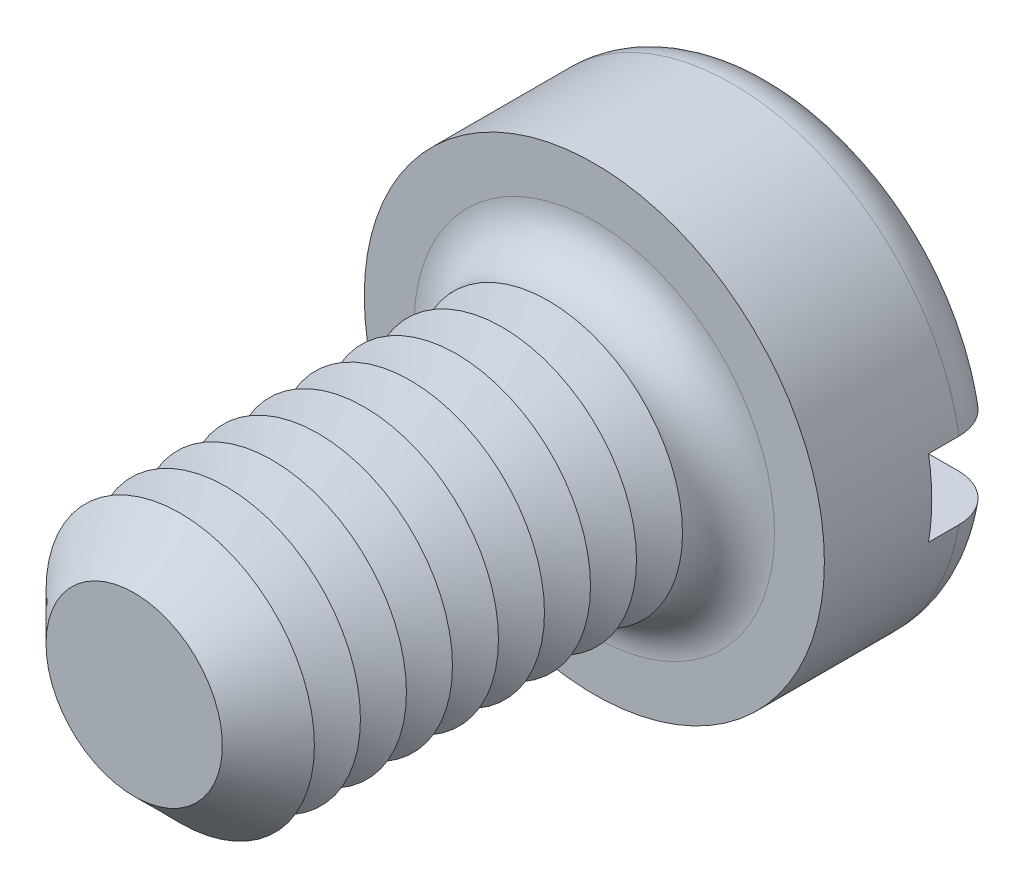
ISO-10303-21;
HEADER;
FILE_DESCRIPTION(('STEP AP214'),'2;1');
FILE_NAME('part.step','',(''),(''),'','','');
FILE_SCHEMA(('AUTOMOTIVE_DESIGN { 1 0 10303 214 1 1 1 1 }'));
ENDSEC;
DATA;
#1=APPLICATION_CONTEXT('core data for automotive mechanical design processes');
#2=APPLICATION_PROTOCOL_DEFINITION('international standard','automotive_design',2000,#1);
#3=PRODUCT_CONTEXT('',#1,'mechanical');
#4=PRODUCT('Part','Part','',(#3));
#5=PRODUCT_RELATED_PRODUCT_CATEGORY('part','',(#4));
#6=PRODUCT_DEFINITION_FORMATION('','',#4);
#7=PRODUCT_DEFINITION_CONTEXT('part definition',#1,'design');
#8=PRODUCT_DEFINITION('design','',#6,#7);
#9=PRODUCT_DEFINITION_SHAPE('','',#8);
#10=(LENGTH_UNIT() NAMED_UNIT(*) SI_UNIT(.MILLI.,.METRE.));
#11=(NAMED_UNIT(*) PLANE_ANGLE_UNIT() SI_UNIT($,.RADIAN.));
#12=(NAMED_UNIT(*) SI_UNIT($,.STERADIAN.) SOLID_ANGLE_UNIT());
#13=UNCERTAINTY_MEASURE_WITH_UNIT(LENGTH_MEASURE(1.E-05),#10,'distance_accuracy_value','');
#14=(GEOMETRIC_REPRESENTATION_CONTEXT(3) GLOBAL_UNCERTAINTY_ASSIGNED_CONTEXT((#13)) GLOBAL_UNIT_ASSIGNED_CONTEXT((#10,
#11,#12)) REPRESENTATION_CONTEXT('',''));
#15=CARTESIAN_POINT('',(0.,0.,0.));
#16=DIRECTION('',(0.,0.,1.));
#17=DIRECTION('',(1.,0.,0.));
#18=AXIS2_PLACEMENT_3D('',#15,#16,#17);
#19=CARTESIAN_POINT('',(0.,0.,-2.4));
#20=DIRECTION('',(0.,0.,1.));
#21=DIRECTION('',(1.,0.,0.));
#22=AXIS2_PLACEMENT_3D('',#19,#20,#21);
#23=PLANE('',#22);
#24=CARTESIAN_POINT('',(0.,0.,-2.4));
#25=DIRECTION('',(0.,0.,1.));
#26=DIRECTION('',(1.,0.,0.));
#27=AXIS2_PLACEMENT_3D('',#24,#25,#26);
#28=CIRCLE('',#27,2.4);
#29=CARTESIAN_POINT('',(-2.3473389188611,0.5,-2.4));
#30=VERTEX_POINT('',#29);
#31=CARTESIAN_POINT('',(2.3473389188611,0.5,-2.4));
#32=VERTEX_POINT('',#31);
#33=EDGE_CURVE('E116',#30,#32,#28,.F.);
#34=ORIENTED_EDGE('',*,*,#33,.T.);
#35=DIRECTION('',(1.,0.,0.));
#36=VECTOR('',#35,1.);
#37=CARTESIAN_POINT('',(-3.,0.5,-2.4));
#38=LINE('',#37,#36);
#39=EDGE_CURVE('E111',#30,#32,#38,.T.);
#40=ORIENTED_EDGE('',*,*,#39,.F.);
#41=EDGE_LOOP('',(#34,#40));
#42=FACE_BOUND('',#41,.T.);
#43=ADVANCED_FACE('F39',(#42),#23,.F.);
#44=CARTESIAN_POINT('',(0.,0.,-1.8));
#45=DIRECTION('',(0.,0.,1.));
#46=DIRECTION('',(1.,0.,0.));
#47=AXIS2_PLACEMENT_3D('',#44,#45,#46);
#48=TOROIDAL_SURFACE('',#47,2.4,0.6);
#49=CARTESIAN_POINT('',(-2.85761641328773,0.5,-2.13010535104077));
#50=CARTESIAN_POINT('',(-2.83871556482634,0.5,-2.1583605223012));
#51=CARTESIAN_POINT('',(-2.81738546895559,0.5,-2.18502342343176));
#52=CARTESIAN_POINT('',(-2.7705148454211,0.5,-2.23439244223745));
#53=CARTESIAN_POINT('',(-2.74496859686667,0.5,-2.25709309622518));
#54=CARTESIAN_POINT('',(-2.6904684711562,0.5,-2.29787524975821));
#55=CARTESIAN_POINT('',(-2.66151863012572,0.5,-2.3159621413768));
#56=CARTESIAN_POINT('',(-2.60103287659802,0.5,-2.34708203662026));
#57=CARTESIAN_POINT('',(-2.56949759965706,0.5,-2.36011627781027));
#58=CARTESIAN_POINT('',(-2.50430694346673,0.5,-2.38095952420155));
#59=CARTESIAN_POINT('',(-2.47062984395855,0.5,-2.38870056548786));
#60=CARTESIAN_POINT('',(-2.40245905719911,0.5,-2.39852415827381));
#61=CARTESIAN_POINT('',(-2.36796525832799,0.5,-2.40060593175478));
#62=CARTESIAN_POINT('',(-2.29850850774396,0.5,-2.39907718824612));
#63=CARTESIAN_POINT('',(-2.2635477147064,0.5,-2.3953679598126));
#64=CARTESIAN_POINT('',(-2.19472542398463,0.5,-2.38219781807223));
#65=CARTESIAN_POINT('',(-2.16086402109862,0.5,-2.37273641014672));
#66=CARTESIAN_POINT('',(-2.09483473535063,0.5,-2.3481926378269));
#67=CARTESIAN_POINT('',(-2.06268841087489,0.5,-2.3330521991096));
#68=CARTESIAN_POINT('',(-2.00140871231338,0.5,-2.29756210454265));
#69=CARTESIAN_POINT('',(-1.97227539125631,0.5,-2.27721235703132));
#70=CARTESIAN_POINT('',(-1.91805676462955,0.5,-2.23196210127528));
#71=CARTESIAN_POINT('',(-1.89294995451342,0.5,-2.20708739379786));
#72=CARTESIAN_POINT('',(-1.84740424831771,0.5,-2.1533758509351));
#73=CARTESIAN_POINT('',(-1.82696468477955,0.5,-2.12453958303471));
#74=CARTESIAN_POINT('',(-1.7919439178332,0.5,-2.06452274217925));
#75=CARTESIAN_POINT('',(-1.7772221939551,0.5,-2.03342424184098));
#76=CARTESIAN_POINT('',(-1.75343025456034,0.5,-1.96913621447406));
#77=CARTESIAN_POINT('',(-1.74435859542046,0.5,-1.93594722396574));
#78=CARTESIAN_POINT('',(-1.73243855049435,0.5,-1.86969199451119));
#79=CARTESIAN_POINT('',(-1.72938008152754,0.5,-1.83666346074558));
#80=CARTESIAN_POINT('',(-1.72896592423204,0.5,-1.77057287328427));
#81=CARTESIAN_POINT('',(-1.73160950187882,0.5,-1.73751082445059));
#82=CARTESIAN_POINT('',(-1.7423966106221,0.5,-1.67291835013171));
#83=CARTESIAN_POINT('',(-1.75043952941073,0.5,-1.64137102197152));
#84=CARTESIAN_POINT('',(-1.77163396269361,0.5,-1.58004446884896));
#85=CARTESIAN_POINT('',(-1.78478577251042,0.5,-1.55026534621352));
#86=CARTESIAN_POINT('',(-1.81598186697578,0.5,-1.49283859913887));
#87=CARTESIAN_POINT('',(-1.83409369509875,0.5,-1.46522772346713));
#88=CARTESIAN_POINT('',(-1.87455179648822,0.5,-1.41330756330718));
#89=CARTESIAN_POINT('',(-1.89689874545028,0.5,-1.38899880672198));
#90=CARTESIAN_POINT('',(-1.94600584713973,0.5,-1.34349499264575));
#91=CARTESIAN_POINT('',(-1.97289034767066,0.5,-1.32243411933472));
#92=CARTESIAN_POINT('',(-2.02972905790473,0.5,-1.28496935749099));
#93=CARTESIAN_POINT('',(-2.05968375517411,0.5,-1.26856621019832));
#94=CARTESIAN_POINT('',(-2.12276894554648,0.5,-1.24040709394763));
#95=CARTESIAN_POINT('',(-2.15596700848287,0.5,-1.22880230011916));
#96=CARTESIAN_POINT('',(-2.22383000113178,0.5,-1.21126311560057));
#97=CARTESIAN_POINT('',(-2.25849504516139,0.5,-1.20532916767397));
#98=CARTESIAN_POINT('',(-2.32870403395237,0.5,-1.1992792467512));
#99=CARTESIAN_POINT('',(-2.36425340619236,0.5,-1.19922586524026));
#100=CARTESIAN_POINT('',(-2.4348506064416,0.5,-1.2051326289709));
#101=CARTESIAN_POINT('',(-2.4698984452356,0.5,-1.21109264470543));
#102=CARTESIAN_POINT('',(-2.53821803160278,0.5,-1.22883658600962));
#103=CARTESIAN_POINT('',(-2.57150081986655,0.5,-1.24057794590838));
#104=CARTESIAN_POINT('',(-2.63557260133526,0.5,-1.2695744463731));
#105=CARTESIAN_POINT('',(-2.66636179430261,0.5,-1.28682914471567));
#106=CARTESIAN_POINT('',(-2.72402406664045,0.5,-1.32606063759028));
#107=CARTESIAN_POINT('',(-2.75095352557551,0.5,-1.34795455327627));
#108=CARTESIAN_POINT('',(-2.80067182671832,0.5,-1.39602603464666));
#109=CARTESIAN_POINT('',(-2.82346106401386,0.5,-1.42220319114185));
#110=CARTESIAN_POINT('',(-2.86383281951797,0.5,-1.47760238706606));
#111=CARTESIAN_POINT('',(-2.88149947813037,0.5,-1.50676312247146));
#112=CARTESIAN_POINT('',(-2.91160874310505,0.5,-1.56766595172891));
#113=CARTESIAN_POINT('',(-2.92405198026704,0.5,-1.59940773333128));
#114=CARTESIAN_POINT('',(-2.94319943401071,0.5,-1.66411282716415));
#115=CARTESIAN_POINT('',(-2.94997843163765,0.5,-1.69705402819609));
#116=CARTESIAN_POINT('',(-2.95787009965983,0.5,-1.7636173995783));
#117=CARTESIAN_POINT('',(-2.95898157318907,0.5,-1.79723971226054));
#118=CARTESIAN_POINT('',(-2.95551354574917,0.5,-1.86397776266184));
#119=CARTESIAN_POINT('',(-2.95096897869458,0.5,-1.89709534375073));
#120=CARTESIAN_POINT('',(-2.93638731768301,0.5,-1.96206785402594));
#121=CARTESIAN_POINT('',(-2.92635713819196,0.5,-1.99392431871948));
#122=CARTESIAN_POINT('',(-2.90618743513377,0.5,-2.04315073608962));
#123=CARTESIAN_POINT('',(-2.89769874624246,0.5,-2.06121519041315));
#124=CARTESIAN_POINT('',(-2.87895753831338,0.5,-2.096404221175));
#125=CARTESIAN_POINT('',(-2.86870503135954,0.5,-2.11352880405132));
#126=CARTESIAN_POINT('',(-2.85761641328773,0.5,-2.13010535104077));
#127=B_SPLINE_CURVE_WITH_KNOTS('',3,(#49,#50,#51,#52,#53,#54,#55,#56,#57,#58,#59,#60,#61,#62,
#63,#64,#65,#66,#67,#68,#69,#70,#71,#72,#73,#74,#75,#76,#77,#78,#79,#80,#81,#82,#83,#84,#85,#86,
#87,#88,#89,#90,#91,#92,#93,#94,#95,#96,#97,#98,#99,#100,#101,#102,#103,#104,#105,#106,#107,
#108,#109,#110,#111,#112,#113,#114,#115,#116,#117,#118,#119,#120,#121,#122,#123,#124,#125,#126),
.UNSPECIFIED.,.T.,.F.,(4,2,2,2,2,2,2,2,2,2,2,2,2,2,2,2,2,2,2,2,2,2,2,2,2,2,2,2,2,2,2,2,2,2,2,2,
2,2,4),(0.,0.101907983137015,0.203955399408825,0.305883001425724,0.407785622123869,
0.510973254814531,0.614175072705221,0.719155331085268,0.824144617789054,0.930238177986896,
1.03633360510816,1.14184204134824,1.24733537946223,1.35004136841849,1.45272110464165,
1.5517448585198,1.65075586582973,1.74797128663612,1.84519232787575,1.9438094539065,
2.0424423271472,2.14443321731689,2.24644032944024,2.35145317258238,2.45647421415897,
2.56261297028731,2.66874944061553,2.77411589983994,2.87947390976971,2.98308820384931,
3.08669260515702,3.18848388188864,3.29026286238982,3.39067588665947,3.49111011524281,
3.59092708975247,3.69061853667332,3.75040561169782,3.81019227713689),.UNSPECIFIED.);
#128=CARTESIAN_POINT('',(-2.95803989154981,0.5,-1.8));
#129=VERTEX_POINT('',#128);
#130=EDGE_CURVE('E243',#129,#30,#127,.T.);
#131=ORIENTED_EDGE('',*,*,#130,.F.);
#132=CARTESIAN_POINT('',(0.,0.,-1.8));
#133=DIRECTION('',(0.,0.,1.));
#134=DIRECTION('',(1.,0.,0.));
#135=AXIS2_PLACEMENT_3D('',#132,#133,#134);
#136=CIRCLE('',#135,3.);
#137=CARTESIAN_POINT('',(2.95803989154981,0.5,-1.8));
#138=VERTEX_POINT('',#137);
#139=EDGE_CURVE('E125',#138,#129,#136,.T.);
#140=ORIENTED_EDGE('',*,*,#139,.F.);
#141=CARTESIAN_POINT('',(1.78664846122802,0.5,-2.05158390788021));
#142=CARTESIAN_POINT('',(1.80142751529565,0.5,-2.08239430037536));
#143=CARTESIAN_POINT('',(1.81889355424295,0.5,-2.111949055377));
#144=CARTESIAN_POINT('',(1.8585933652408,0.5,-2.16770384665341));
#145=CARTESIAN_POINT('',(1.88083491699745,0.5,-2.19389829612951));
#146=CARTESIAN_POINT('',(1.92931942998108,0.5,-2.24217519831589));
#147=CARTESIAN_POINT('',(1.95555471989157,0.5,-2.26426535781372));
#148=CARTESIAN_POINT('',(2.01127789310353,0.5,-2.30384045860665));
#149=CARTESIAN_POINT('',(2.04076488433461,0.5,-2.32132665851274));
#150=CARTESIAN_POINT('',(2.10290022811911,0.5,-2.3516259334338));
#151=CARTESIAN_POINT('',(2.13560600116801,0.5,-2.3643213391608));
#152=CARTESIAN_POINT('',(2.20267136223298,0.5,-2.38412242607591));
#153=CARTESIAN_POINT('',(2.23703118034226,0.5,-2.3912273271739));
#154=CARTESIAN_POINT('',(2.30690186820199,0.5,-2.39969404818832));
#155=CARTESIAN_POINT('',(2.34242185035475,0.5,-2.40098100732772));
#156=CARTESIAN_POINT('',(2.41317063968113,0.5,-2.39753827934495));
#157=CARTESIAN_POINT('',(2.44839945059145,0.5,-2.39280866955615));
#158=CARTESIAN_POINT('',(2.51734146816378,0.5,-2.37746773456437));
#159=CARTESIAN_POINT('',(2.55106223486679,0.5,-2.3668904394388));
#160=CARTESIAN_POINT('',(2.61620389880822,0.5,-2.34013333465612));
#161=CARTESIAN_POINT('',(2.64762498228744,0.5,-2.32395397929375));
#162=CARTESIAN_POINT('',(2.70673284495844,0.5,-2.28672393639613));
#163=CARTESIAN_POINT('',(2.73447138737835,0.5,-2.26575544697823));
#164=CARTESIAN_POINT('',(2.78595339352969,0.5,-2.21938197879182));
#165=CARTESIAN_POINT('',(2.80969724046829,0.5,-2.19397742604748));
#166=CARTESIAN_POINT('',(2.85207235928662,0.5,-2.13993965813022));
#167=CARTESIAN_POINT('',(2.87078674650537,0.5,-2.11137160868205));
#168=CARTESIAN_POINT('',(2.90307455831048,0.5,-2.05146448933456));
#169=CARTESIAN_POINT('',(2.91664841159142,0.5,-2.02012565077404));
#170=CARTESIAN_POINT('',(2.93808283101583,0.5,-1.95603682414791));
#171=CARTESIAN_POINT('',(2.94602016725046,0.5,-1.92331249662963));
#172=CARTESIAN_POINT('',(2.95624273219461,0.5,-1.85699296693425));
#173=CARTESIAN_POINT('',(2.95852824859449,0.5,-1.82339780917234));
#174=CARTESIAN_POINT('',(2.95738171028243,0.5,-1.75655451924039));
#175=CARTESIAN_POINT('',(2.95399174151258,0.5,-1.72330565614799));
#176=CARTESIAN_POINT('',(2.94167749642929,0.5,-1.65784996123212));
#177=CARTESIAN_POINT('',(2.93275329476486,0.5,-1.62564311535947));
#178=CARTESIAN_POINT('',(2.90963870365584,0.5,-1.56317641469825));
#179=CARTESIAN_POINT('',(2.89544787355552,0.5,-1.53291672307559));
#180=CARTESIAN_POINT('',(2.86222325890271,0.5,-1.47518589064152));
#181=CARTESIAN_POINT('',(2.84318935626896,0.5,-1.44771481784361));
#182=CARTESIAN_POINT('',(2.80067851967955,0.5,-1.39611362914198));
#183=CARTESIAN_POINT('',(2.77716960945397,0.5,-1.37200986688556));
#184=CARTESIAN_POINT('',(2.72648704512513,0.5,-1.3280274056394));
#185=CARTESIAN_POINT('',(2.69931317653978,0.5,-1.3081489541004));
#186=CARTESIAN_POINT('',(2.64167967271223,0.5,-1.27288334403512));
#187=CARTESIAN_POINT('',(2.61118015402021,0.5,-1.25756138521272));
#188=CARTESIAN_POINT('',(2.54807315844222,0.5,-1.2321564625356));
#189=CARTESIAN_POINT('',(2.51546550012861,0.5,-1.22207395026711));
#190=CARTESIAN_POINT('',(2.44846246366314,0.5,-1.20724783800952));
#191=CARTESIAN_POINT('',(2.41404584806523,0.5,-1.2026002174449));
#192=CARTESIAN_POINT('',(2.34491756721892,0.5,-1.19904907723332));
#193=CARTESIAN_POINT('',(2.3102058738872,0.5,-1.20014611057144));
#194=CARTESIAN_POINT('',(2.24087507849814,0.5,-1.20808958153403));
#195=CARTESIAN_POINT('',(2.20626660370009,0.5,-1.21502895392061));
#196=CARTESIAN_POINT('',(2.13868705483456,0.5,-1.23457616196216));
#197=CARTESIAN_POINT('',(2.10571611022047,0.5,-1.24718444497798));
#198=CARTESIAN_POINT('',(2.04212010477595,0.5,-1.2778419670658));
#199=CARTESIAN_POINT('',(2.0115131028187,0.5,-1.29592871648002));
#200=CARTESIAN_POINT('',(1.95381117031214,0.5,-1.33703838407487));
#201=CARTESIAN_POINT('',(1.92671618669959,0.5,-1.36006122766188));
#202=CARTESIAN_POINT('',(1.8771749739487,0.5,-1.41014760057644));
#203=CARTESIAN_POINT('',(1.85467966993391,0.5,-1.43716252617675));
#204=CARTESIAN_POINT('',(1.8147167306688,0.5,-1.49468601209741));
#205=CARTESIAN_POINT('',(1.79724791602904,0.5,-1.52519375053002));
#206=CARTESIAN_POINT('',(1.76843420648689,0.5,-1.58782676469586));
#207=CARTESIAN_POINT('',(1.75691546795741,0.5,-1.61987202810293));
#208=CARTESIAN_POINT('',(1.73963101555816,0.5,-1.68548715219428));
#209=CARTESIAN_POINT('',(1.73386545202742,0.5,-1.71905705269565));
#210=CARTESIAN_POINT('',(1.72840927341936,0.5,-1.78556262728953));
#211=CARTESIAN_POINT('',(1.72852416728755,0.5,-1.8184825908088));
#212=CARTESIAN_POINT('',(1.73434422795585,0.5,-1.88379362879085));
#213=CARTESIAN_POINT('',(1.74004181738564,0.5,-1.91618535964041));
#214=CARTESIAN_POINT('',(1.75312909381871,0.5,-1.96568884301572));
#215=CARTESIAN_POINT('',(1.75869685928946,0.5,-1.98330302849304));
#216=CARTESIAN_POINT('',(1.77146455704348,0.5,-2.01792824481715));
#217=CARTESIAN_POINT('',(1.7786644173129,0.5,-2.03493930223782));
#218=CARTESIAN_POINT('',(1.78664846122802,0.5,-2.05158390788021));
#219=B_SPLINE_CURVE_WITH_KNOTS('',3,(#141,#142,#143,#144,#145,#146,#147,#148,#149,#150,#151,
#152,#153,#154,#155,#156,#157,#158,#159,#160,#161,#162,#163,#164,#165,#166,#167,#168,#169,#170,
#171,#172,#173,#174,#175,#176,#177,#178,#179,#180,#181,#182,#183,#184,#185,#186,#187,#188,#189,
#190,#191,#192,#193,#194,#195,#196,#197,#198,#199,#200,#201,#202,#203,#204,#205,#206,#207,#208,
#209,#210,#211,#212,#213,#214,#215,#216,#217,#218),.UNSPECIFIED.,.T.,.F.,(4,2,2,2,2,2,2,2,2,2,2,
2,2,2,2,2,2,2,2,2,2,2,2,2,2,2,2,2,2,2,2,2,2,2,2,2,2,2,4),(0.,0.10244464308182,0.205057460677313,
0.307475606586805,0.409865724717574,0.514628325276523,0.619405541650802,0.72552718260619,
0.831647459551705,0.937156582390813,1.04265715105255,1.1464674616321,1.25026780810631,
1.3522293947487,1.45418247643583,1.55471883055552,1.6552500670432,1.75503912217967,
1.8548268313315,1.95462289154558,2.05442138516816,2.15496174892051,2.25550799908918,
2.35743049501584,2.45936177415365,2.56306719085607,2.66678259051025,2.77217967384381,
2.87758507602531,2.98372914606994,3.08987161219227,3.19481457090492,3.29973288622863,
3.40138228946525,3.50303434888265,3.60132659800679,3.69948562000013,3.75483142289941,
3.8101747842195),.UNSPECIFIED.);
#220=EDGE_CURVE('E245',#32,#138,#219,.T.);
#221=ORIENTED_EDGE('',*,*,#220,.F.);
#222=ORIENTED_EDGE('',*,*,#33,.F.);
#223=EDGE_LOOP('',(#131,#140,#221,#222));
#224=FACE_BOUND('',#223,.T.);
#225=ADVANCED_FACE('F227',(#224),#48,.T.);
#226=CARTESIAN_POINT('',(0.,0.,-2.4));
#227=DIRECTION('',(0.,0.,1.));
#228=DIRECTION('',(1.,0.,0.));
#229=AXIS2_PLACEMENT_3D('',#226,#227,#228);
#230=CYLINDRICAL_SURFACE('',#229,3.);
#231=DIRECTION('',(0.,0.,1.));
#232=VECTOR('',#231,1.);
#233=CARTESIAN_POINT('',(2.95803989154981,0.5,-2.4));
#234=LINE('',#233,#232);
#235=CARTESIAN_POINT('',(2.95803989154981,0.5,-1.4));
#236=VERTEX_POINT('',#235);
#237=EDGE_CURVE('E259',#138,#236,#234,.T.);
#238=ORIENTED_EDGE('',*,*,#237,.F.);
#239=ORIENTED_EDGE('',*,*,#139,.T.);
#240=DIRECTION('',(0.,0.,1.));
#241=VECTOR('',#240,1.);
#242=CARTESIAN_POINT('',(-2.95803989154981,0.5,-2.4));
#243=LINE('',#242,#241);
#244=CARTESIAN_POINT('',(-2.95803989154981,0.5,-1.4));
#245=VERTEX_POINT('',#244);
#246=EDGE_CURVE('E63',#245,#129,#243,.F.);
#247=ORIENTED_EDGE('',*,*,#246,.F.);
#248=CARTESIAN_POINT('',(0.,0.,-1.4));
#249=DIRECTION('',(0.,0.,-1.));
#250=DIRECTION('',(-1.,0.,0.));
#251=AXIS2_PLACEMENT_3D('',#248,#249,#250);
#252=CIRCLE('',#251,3.);
#253=CARTESIAN_POINT('',(-2.95803989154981,-0.5,-1.4));
#254=VERTEX_POINT('',#253);
#255=EDGE_CURVE('E43',#245,#254,#252,.F.);
#256=ORIENTED_EDGE('',*,*,#255,.T.);
#257=DIRECTION('',(0.,0.,1.));
#258=VECTOR('',#257,1.);
#259=CARTESIAN_POINT('',(-2.95803989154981,-0.5,-2.4));
#260=LINE('',#259,#258);
#261=CARTESIAN_POINT('',(-2.9580398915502,-0.5,-1.79999999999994));
#262=VERTEX_POINT('',#261);
#263=EDGE_CURVE('E256',#262,#254,#260,.T.);
#264=ORIENTED_EDGE('',*,*,#263,.F.);
#265=CARTESIAN_POINT('',(2.95803989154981,-0.5,-1.8));
#266=VERTEX_POINT('',#265);
#267=EDGE_CURVE('E127',#262,#266,#136,.T.);
#268=ORIENTED_EDGE('',*,*,#267,.T.);
#269=DIRECTION('',(0.,0.,1.));
#270=VECTOR('',#269,1.);
#271=CARTESIAN_POINT('',(2.95803989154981,-0.5,-2.4));
#272=LINE('',#271,#270);
#273=CARTESIAN_POINT('',(2.95803989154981,-0.5,-1.4));
#274=VERTEX_POINT('',#273);
#275=EDGE_CURVE('E55',#274,#266,#272,.F.);
#276=ORIENTED_EDGE('',*,*,#275,.F.);
#277=EDGE_CURVE('E11',#274,#236,#252,.F.);
#278=ORIENTED_EDGE('',*,*,#277,.T.);
#279=EDGE_LOOP('',(#238,#239,#247,#256,#264,#268,#276,#278));
#280=FACE_BOUND('',#279,.T.);
#281=CARTESIAN_POINT('',(0.,0.,0.));
#282=DIRECTION('',(0.,0.,1.));
#283=DIRECTION('',(1.,0.,0.));
#284=AXIS2_PLACEMENT_3D('',#281,#282,#283);
#285=CIRCLE('',#284,3.);
#286=CARTESIAN_POINT('',(3.,0.,0.));
#287=VERTEX_POINT('',#286);
#288=EDGE_CURVE('E262',#287,#287,#285,.T.);
#289=ORIENTED_EDGE('',*,*,#288,.F.);
#290=EDGE_LOOP('',(#289));
#291=FACE_BOUND('',#290,.T.);
#292=ADVANCED_FACE('F223',(#280,#291),#230,.T.);
#293=CARTESIAN_POINT('',(2.3473389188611,-0.5,-2.4));
#294=VERTEX_POINT('',#293);
#295=CARTESIAN_POINT('',(-2.3473389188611,-0.5,-2.4));
#296=VERTEX_POINT('',#295);
#297=EDGE_CURVE('E109',#294,#296,#28,.F.);
#298=ORIENTED_EDGE('',*,*,#297,.T.);
#299=DIRECTION('',(-1.,0.,0.));
#300=VECTOR('',#299,1.);
#301=CARTESIAN_POINT('',(-3.,-0.5,-2.4));
#302=LINE('',#301,#300);
#303=EDGE_CURVE('E96',#294,#296,#302,.T.);
#304=ORIENTED_EDGE('',*,*,#303,.F.);
#305=EDGE_LOOP('',(#298,#304));
#306=FACE_BOUND('',#305,.T.);
#307=ADVANCED_FACE('F108',(#306),#23,.F.);
#308=CARTESIAN_POINT('',(0.,0.,0.));
#309=DIRECTION('',(0.,0.,1.));
#310=DIRECTION('',(1.,0.,0.));
#311=AXIS2_PLACEMENT_3D('',#308,#309,#310);
#312=PLANE('',#311);
#313=CARTESIAN_POINT('',(0.,0.,0.));
#314=DIRECTION('',(0.,0.,1.));
#315=DIRECTION('',(1.,0.,0.));
#316=AXIS2_PLACEMENT_3D('',#313,#314,#315);
#317=CIRCLE('',#316,2.35);
#318=CARTESIAN_POINT('',(2.35,0.,0.));
#319=VERTEX_POINT('',#318);
#320=EDGE_CURVE('E115',#319,#319,#317,.F.);
#321=ORIENTED_EDGE('',*,*,#320,.T.);
#322=EDGE_LOOP('',(#321));
#323=FACE_BOUND('',#322,.T.);
#324=ORIENTED_EDGE('',*,*,#288,.T.);
#325=EDGE_LOOP('',(#324));
#326=FACE_BOUND('',#325,.T.);
#327=ADVANCED_FACE('F222',(#323,#326),#312,.T.);
#328=CARTESIAN_POINT('',(-2.85761641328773,-0.5,-2.13010535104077));
#329=CARTESIAN_POINT('',(-2.87617085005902,-0.5,-2.10236255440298));
#330=CARTESIAN_POINT('',(-2.89241094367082,-0.5,-2.07304478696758));
#331=CARTESIAN_POINT('',(-2.91975805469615,-0.5,-2.01207835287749));
#332=CARTESIAN_POINT('',(-2.93085958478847,-0.5,-1.98042723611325));
#333=CARTESIAN_POINT('',(-2.94757590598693,-0.5,-1.91570997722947));
#334=CARTESIAN_POINT('',(-2.95319165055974,-0.5,-1.88264408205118));
#335=CARTESIAN_POINT('',(-2.95876526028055,-0.5,-1.81604673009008));
#336=CARTESIAN_POINT('',(-2.95872441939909,-0.5,-1.78251538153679));
#337=CARTESIAN_POINT('',(-2.95300126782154,-0.5,-1.71606888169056));
#338=CARTESIAN_POINT('',(-2.94734076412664,-0.5,-1.68315184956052));
#339=CARTESIAN_POINT('',(-2.93058183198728,-0.5,-1.61873244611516));
#340=CARTESIAN_POINT('',(-2.91948325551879,-0.5,-1.58723011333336));
#341=CARTESIAN_POINT('',(-2.89215903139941,-0.5,-1.52647404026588));
#342=CARTESIAN_POINT('',(-2.87592518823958,-0.5,-1.49722398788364));
#343=CARTESIAN_POINT('',(-2.83881787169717,-0.5,-1.44183365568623));
#344=CARTESIAN_POINT('',(-2.81794425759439,-0.5,-1.41569347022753));
#345=CARTESIAN_POINT('',(-2.77196258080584,-0.5,-1.36700890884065));
#346=CARTESIAN_POINT('',(-2.74681874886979,-0.5,-1.34449832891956));
#347=CARTESIAN_POINT('',(-2.69315595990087,-0.5,-1.30394571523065));
#348=CARTESIAN_POINT('',(-2.66463678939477,-0.5,-1.28590396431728));
#349=CARTESIAN_POINT('',(-2.6045885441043,-0.5,-1.25451133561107));
#350=CARTESIAN_POINT('',(-2.573021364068,-0.5,-1.24123336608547));
#351=CARTESIAN_POINT('',(-2.50813094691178,-0.5,-1.22006271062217));
#352=CARTESIAN_POINT('',(-2.47480755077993,-0.5,-1.21217051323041));
#353=CARTESIAN_POINT('',(-2.40672281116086,-0.5,-1.20185046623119));
#354=CARTESIAN_POINT('',(-2.37194646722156,-0.5,-1.19952155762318));
#355=CARTESIAN_POINT('',(-2.30248663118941,-0.5,-1.20064178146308));
#356=CARTESIAN_POINT('',(-2.26780314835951,-0.5,-1.20409147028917));
#357=CARTESIAN_POINT('',(-2.19896003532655,-0.5,-1.21674803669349));
#358=CARTESIAN_POINT('',(-2.16481620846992,-0.5,-1.22604100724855));
#359=CARTESIAN_POINT('',(-2.09855902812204,-0.5,-1.25020237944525));
#360=CARTESIAN_POINT('',(-2.0664458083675,-0.5,-1.2650711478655));
#361=CARTESIAN_POINT('',(-2.00504979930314,-0.5,-1.3000633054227));
#362=CARTESIAN_POINT('',(-1.97577870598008,-0.5,-1.32020724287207));
#363=CARTESIAN_POINT('',(-1.92109882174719,-0.5,-1.36519538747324));
#364=CARTESIAN_POINT('',(-1.89568984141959,-0.5,-1.39003936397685));
#365=CARTESIAN_POINT('',(-1.84992350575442,-0.5,-1.44333696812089));
#366=CARTESIAN_POINT('',(-1.82949305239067,-0.5,-1.47172774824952));
#367=CARTESIAN_POINT('',(-1.79388305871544,-0.5,-1.53163225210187));
#368=CARTESIAN_POINT('',(-1.77870235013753,-0.5,-1.56314527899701));
#369=CARTESIAN_POINT('',(-1.7545759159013,-0.5,-1.62726698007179));
#370=CARTESIAN_POINT('',(-1.74543784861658,-0.5,-1.65980327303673));
#371=CARTESIAN_POINT('',(-1.73294830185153,-0.5,-1.72596654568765));
#372=CARTESIAN_POINT('',(-1.72959555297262,-0.5,-1.7595932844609));
#373=CARTESIAN_POINT('',(-1.72881879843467,-0.5,-1.82588200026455));
#374=CARTESIAN_POINT('',(-1.73121660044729,-0.5,-1.85854202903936));
#375=CARTESIAN_POINT('',(-1.74148022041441,-0.5,-1.9229888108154));
#376=CARTESIAN_POINT('',(-1.74934586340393,-0.5,-1.95477559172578));
#377=CARTESIAN_POINT('',(-1.77023164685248,-0.5,-2.01650910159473));
#378=CARTESIAN_POINT('',(-1.78323812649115,-0.5,-2.04646046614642));
#379=CARTESIAN_POINT('',(-1.81396733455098,-0.5,-2.10383471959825));
#380=CARTESIAN_POINT('',(-1.83169061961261,-0.5,-2.13125730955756));
#381=CARTESIAN_POINT('',(-1.87183626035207,-0.5,-2.18359240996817));
#382=CARTESIAN_POINT('',(-1.89437158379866,-0.5,-2.20841820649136));
#383=CARTESIAN_POINT('',(-1.9431646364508,-0.5,-2.25409214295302));
#384=CARTESIAN_POINT('',(-1.96942301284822,-0.5,-2.27493958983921));
#385=CARTESIAN_POINT('',(-2.025898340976,-0.5,-2.31281042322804));
#386=CARTESIAN_POINT('',(-2.05622082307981,-0.5,-2.32967654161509));
#387=CARTESIAN_POINT('',(-2.11922391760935,-0.5,-2.35820255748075));
#388=CARTESIAN_POINT('',(-2.15190483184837,-0.5,-2.3698617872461));
#389=CARTESIAN_POINT('',(-2.21944675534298,-0.5,-2.38785911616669));
#390=CARTESIAN_POINT('',(-2.25433929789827,-0.5,-2.39407914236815));
#391=CARTESIAN_POINT('',(-2.32467357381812,-0.5,-2.40058243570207));
#392=CARTESIAN_POINT('',(-2.36011530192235,-0.5,-2.40086575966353));
#393=CARTESIAN_POINT('',(-2.43058129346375,-0.5,-2.39545061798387));
#394=CARTESIAN_POINT('',(-2.46560504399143,-0.5,-2.38974544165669));
#395=CARTESIAN_POINT('',(-2.53418188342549,-0.5,-2.37245602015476));
#396=CARTESIAN_POINT('',(-2.56773468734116,-0.5,-2.36087064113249));
#397=CARTESIAN_POINT('',(-2.63195003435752,-0.5,-2.33229154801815));
#398=CARTESIAN_POINT('',(-2.66264330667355,-0.5,-2.31536681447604));
#399=CARTESIAN_POINT('',(-2.72065333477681,-0.5,-2.2765252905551));
#400=CARTESIAN_POINT('',(-2.7479744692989,-0.5,-2.25461508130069));
#401=CARTESIAN_POINT('',(-2.78903570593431,-0.5,-2.21539504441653));
#402=CARTESIAN_POINT('',(-2.80405150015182,-0.5,-2.19939833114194));
#403=CARTESIAN_POINT('',(-2.83224965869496,-0.5,-2.16586257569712));
#404=CARTESIAN_POINT('',(-2.84543204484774,-0.5,-2.14832355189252));
#405=CARTESIAN_POINT('',(-2.85761641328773,-0.5,-2.13010535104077));
#406=B_SPLINE_CURVE_WITH_KNOTS('',3,(#328,#329,#330,#331,#332,#333,#334,#335,#336,#337,#338,
#339,#340,#341,#342,#343,#344,#345,#346,#347,#348,#349,#350,#351,#352,#353,#354,#355,#356,#357,
#358,#359,#360,#361,#362,#363,#364,#365,#366,#367,#368,#369,#370,#371,#372,#373,#374,#375,#376,
#377,#378,#379,#380,#381,#382,#383,#384,#385,#386,#387,#388,#389,#390,#391,#392,#393,#394,#395,
#396,#397,#398,#399,#400,#401,#402,#403,#404,#405),.UNSPECIFIED.,.T.,.F.,(4,2,2,2,2,2,2,2,2,2,2,
2,2,2,2,2,2,2,2,2,2,2,2,2,2,2,2,2,2,2,2,2,2,2,2,2,2,2,4),(0.,0.100047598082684,
0.200201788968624,0.300338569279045,0.400452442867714,0.500179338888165,0.599908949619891,
0.699798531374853,0.799691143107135,0.900465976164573,1.00124718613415,1.10351091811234,
1.20578392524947,1.30986270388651,1.41395150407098,1.51961105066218,1.62527754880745,
1.73136193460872,1.83744111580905,1.94185359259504,2.04624281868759,2.1471248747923,
2.24798479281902,2.34575994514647,2.44353196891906,2.541045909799,2.63857136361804,
2.73870431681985,2.83885469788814,2.94247024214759,3.0460990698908,3.15192527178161,
3.25775046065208,3.36369436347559,3.46965870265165,3.57430655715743,3.67881706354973,
3.74451732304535,3.81021680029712),.UNSPECIFIED.);
#407=EDGE_CURVE('E103',#296,#262,#406,.T.);
#408=ORIENTED_EDGE('',*,*,#407,.F.);
#409=ORIENTED_EDGE('',*,*,#297,.F.);
#410=CARTESIAN_POINT('',(1.78664846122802,-0.5,-2.05158390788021));
#411=CARTESIAN_POINT('',(1.77253256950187,-0.5,-2.02214917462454));
#412=CARTESIAN_POINT('',(1.76084795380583,-0.5,-1.99152692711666));
#413=CARTESIAN_POINT('',(1.74276267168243,-0.5,-1.92873811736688));
#414=CARTESIAN_POINT('',(1.73636622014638,-0.5,-1.89657034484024));
#415=CARTESIAN_POINT('',(1.72910271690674,-0.5,-1.83160458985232));
#416=CARTESIAN_POINT('',(1.72823699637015,-0.5,-1.79880645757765));
#417=CARTESIAN_POINT('',(1.73207277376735,-0.5,-1.73354460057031));
#418=CARTESIAN_POINT('',(1.7367732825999,-0.5,-1.70108081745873));
#419=CARTESIAN_POINT('',(1.75151033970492,-0.5,-1.63763571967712));
#420=CARTESIAN_POINT('',(1.76150868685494,-0.5,-1.60664550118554));
#421=CARTESIAN_POINT('',(1.78646773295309,-0.5,-1.54673433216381));
#422=CARTESIAN_POINT('',(1.80142897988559,-0.5,-1.51781361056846));
#423=CARTESIAN_POINT('',(1.8361687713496,-0.5,-1.46223275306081));
#424=CARTESIAN_POINT('',(1.85603637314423,-0.5,-1.43562834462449));
#425=CARTESIAN_POINT('',(1.89981598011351,-0.5,-1.38598822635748));
#426=CARTESIAN_POINT('',(1.92372865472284,-0.5,-1.3629531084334));
#427=CARTESIAN_POINT('',(1.97581791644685,-0.5,-1.32025912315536));
#428=CARTESIAN_POINT('',(2.00411431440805,-0.5,-1.30074638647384));
#429=CARTESIAN_POINT('',(2.06351340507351,-0.5,-1.26660223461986));
#430=CARTESIAN_POINT('',(2.09461651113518,-0.5,-1.2519715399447));
#431=CARTESIAN_POINT('',(2.15964055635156,-0.5,-1.22763649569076));
#432=CARTESIAN_POINT('',(2.19361437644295,-0.5,-1.21807321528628));
#433=CARTESIAN_POINT('',(2.26268197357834,-0.5,-1.20474094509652));
#434=CARTESIAN_POINT('',(2.29777581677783,-0.5,-1.20097229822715));
#435=CARTESIAN_POINT('',(2.36834397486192,-0.5,-1.19935270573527));
#436=CARTESIAN_POINT('',(2.40381924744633,-0.5,-1.20154258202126));
#437=CARTESIAN_POINT('',(2.47388621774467,-0.5,-1.211906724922));
#438=CARTESIAN_POINT('',(2.50847794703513,-0.5,-1.22008077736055));
#439=CARTESIAN_POINT('',(2.57542869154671,-0.5,-1.24211740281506));
#440=CARTESIAN_POINT('',(2.60780612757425,-0.5,-1.25592395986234));
#441=CARTESIAN_POINT('',(2.66972487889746,-0.5,-1.28886991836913));
#442=CARTESIAN_POINT('',(2.69926644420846,-0.5,-1.3080088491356));
#443=CARTESIAN_POINT('',(2.75412764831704,-0.5,-1.35072337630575));
#444=CARTESIAN_POINT('',(2.77951140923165,-0.5,-1.37421661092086));
#445=CARTESIAN_POINT('',(2.82588981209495,-0.5,-1.42519687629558));
#446=CARTESIAN_POINT('',(2.84688487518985,-0.5,-1.4526835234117));
#447=CARTESIAN_POINT('',(2.88351678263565,-0.5,-1.51036368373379));
#448=CARTESIAN_POINT('',(2.89923879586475,-0.5,-1.54050312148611));
#449=CARTESIAN_POINT('',(2.92532780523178,-0.5,-1.60301687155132));
#450=CARTESIAN_POINT('',(2.93569520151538,-0.5,-1.63539101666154));
#451=CARTESIAN_POINT('',(2.95066155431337,-0.5,-1.70102985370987));
#452=CARTESIAN_POINT('',(2.95532930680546,-0.5,-1.73427887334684));
#453=CARTESIAN_POINT('',(2.9589838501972,-0.5,-1.80108716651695));
#454=CARTESIAN_POINT('',(2.95797087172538,-0.5,-1.83464642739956));
#455=CARTESIAN_POINT('',(2.9503157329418,-0.5,-1.90093629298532));
#456=CARTESIAN_POINT('',(2.9437032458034,-0.5,-1.93367033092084));
#457=CARTESIAN_POINT('',(2.92508830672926,-0.5,-1.99756717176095));
#458=CARTESIAN_POINT('',(2.91308586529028,-0.5,-2.02872997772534));
#459=CARTESIAN_POINT('',(2.88401713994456,-0.5,-2.08868263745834));
#460=CARTESIAN_POINT('',(2.86693946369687,-0.5,-2.11746696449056));
#461=CARTESIAN_POINT('',(2.82823635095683,-0.5,-2.17179415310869));
#462=CARTESIAN_POINT('',(2.80661076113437,-0.5,-2.19733690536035));
#463=CARTESIAN_POINT('',(2.75921750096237,-0.5,-2.24472182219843));
#464=CARTESIAN_POINT('',(2.73341278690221,-0.5,-2.26652692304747));
#465=CARTESIAN_POINT('',(2.67855512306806,-0.5,-2.30557116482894));
#466=CARTESIAN_POINT('',(2.64950194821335,-0.5,-2.32280998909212));
#467=CARTESIAN_POINT('',(2.58850670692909,-0.5,-2.35251615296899));
#468=CARTESIAN_POINT('',(2.55652763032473,-0.5,-2.36490748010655));
#469=CARTESIAN_POINT('',(2.4909651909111,-0.5,-2.38424946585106));
#470=CARTESIAN_POINT('',(2.45738167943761,-0.5,-2.39119961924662));
#471=CARTESIAN_POINT('',(2.38892891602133,-0.5,-2.39958830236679));
#472=CARTESIAN_POINT('',(2.35404742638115,-0.5,-2.40092701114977));
#473=CARTESIAN_POINT('',(2.28454389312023,-0.5,-2.39781917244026));
#474=CARTESIAN_POINT('',(2.24992186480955,-0.5,-2.39337228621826));
#475=CARTESIAN_POINT('',(2.18139250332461,-0.5,-2.37872879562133));
#476=CARTESIAN_POINT('',(2.14750264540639,-0.5,-2.36845030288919));
#477=CARTESIAN_POINT('',(2.08190943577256,-0.5,-2.34236291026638));
#478=CARTESIAN_POINT('',(2.05020675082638,-0.5,-2.32655233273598));
#479=CARTESIAN_POINT('',(1.98982495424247,-0.5,-2.28976285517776));
#480=CARTESIAN_POINT('',(1.96115527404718,-0.5,-2.26876847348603));
#481=CARTESIAN_POINT('',(1.90785147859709,-0.5,-2.22220002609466));
#482=CARTESIAN_POINT('',(1.88321231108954,-0.5,-2.19663177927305));
#483=CARTESIAN_POINT('',(1.84638483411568,-0.5,-2.15106161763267));
#484=CARTESIAN_POINT('',(1.8328227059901,-0.5,-2.13215328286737));
#485=CARTESIAN_POINT('',(1.80797918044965,-0.5,-2.09289185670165));
#486=CARTESIAN_POINT('',(1.79669771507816,-0.5,-2.07253880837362));
#487=CARTESIAN_POINT('',(1.78664846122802,-0.5,-2.05158390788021));
#488=B_SPLINE_CURVE_WITH_KNOTS('',3,(#410,#411,#412,#413,#414,#415,#416,#417,#418,#419,#420,
#421,#422,#423,#424,#425,#426,#427,#428,#429,#430,#431,#432,#433,#434,#435,#436,#437,#438,#439,
#440,#441,#442,#443,#444,#445,#446,#447,#448,#449,#450,#451,#452,#453,#454,#455,#456,#457,#458,
#459,#460,#461,#462,#463,#464,#465,#466,#467,#468,#469,#470,#471,#472,#473,#474,#475,#476,#477,
#478,#479,#480,#481,#482,#483,#484,#485,#486,#487),.UNSPECIFIED.,.T.,.F.,(4,2,2,2,2,2,2,2,2,2,2,
2,2,2,2,2,2,2,2,2,2,2,2,2,2,2,2,2,2,2,2,2,2,2,2,2,2,2,4),(0.,0.0978512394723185,0.19578039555,
0.293733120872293,0.391668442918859,0.488907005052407,0.58615630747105,0.685320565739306,
0.784501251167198,0.887148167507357,0.989810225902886,1.09519726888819,1.20059054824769,
1.30670769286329,1.41282103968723,1.51790384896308,1.62297738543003,1.72623563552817,
1.82948397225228,1.93097382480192,2.03245609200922,2.13270093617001,2.23294171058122,
2.33265458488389,2.43236726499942,2.53230548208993,2.63224706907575,2.73312861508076,
2.83401715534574,2.93642973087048,3.03885181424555,3.14308833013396,3.24733094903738,
3.35307493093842,3.45885100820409,3.56494689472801,3.67090875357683,3.74057217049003,
3.81023351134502),.UNSPECIFIED.);
#489=EDGE_CURVE('E92',#266,#294,#488,.T.);
#490=ORIENTED_EDGE('',*,*,#489,.F.);
#491=ORIENTED_EDGE('',*,*,#267,.F.);
#492=EDGE_LOOP('',(#408,#409,#490,#491));
#493=FACE_BOUND('',#492,.T.);
#494=ADVANCED_FACE('F113',(#493),#48,.T.);
#495=CARTESIAN_POINT('',(0.,0.,0.6));
#496=DIRECTION('',(0.,0.,1.));
#497=DIRECTION('',(1.,0.,0.));
#498=AXIS2_PLACEMENT_3D('',#495,#496,#497);
#499=TOROIDAL_SURFACE('',#498,2.35,0.6);
#500=ORIENTED_EDGE('',*,*,#320,.F.);
#501=EDGE_LOOP('',(#500));
#502=FACE_BOUND('',#501,.T.);
#503=CARTESIAN_POINT('',(0.,0.,0.6));
#504=DIRECTION('',(0.,0.,-1.));
#505=DIRECTION('',(-1.,0.,0.));
#506=AXIS2_PLACEMENT_3D('',#503,#504,#505);
#507=CIRCLE('',#506,1.75);
#508=CARTESIAN_POINT('',(-1.75,0.,0.6));
#509=VERTEX_POINT('',#508);
#510=EDGE_CURVE('E268',#509,#509,#507,.T.);
#511=ORIENTED_EDGE('',*,*,#510,.T.);
#512=EDGE_LOOP('',(#511));
#513=FACE_BOUND('',#512,.T.);
#514=ADVANCED_FACE('F215',(#502,#513),#499,.F.);
#515=CARTESIAN_POINT('',(0.,0.,0.9));
#516=DIRECTION('',(0.,0.,-1.));
#517=DIRECTION('',(-1.,0.,0.));
#518=AXIS2_PLACEMENT_3D('',#515,#516,#517);
#519=CONICAL_SURFACE('',#518,1.23038475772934,1.0471975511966);
#520=ORIENTED_EDGE('',*,*,#510,.F.);
#521=EDGE_LOOP('',(#520));
#522=FACE_BOUND('',#521,.T.);
#523=CARTESIAN_POINT('',(0.,0.,0.9));
#524=DIRECTION('',(0.,0.,-1.));
#525=DIRECTION('',(-1.,0.,0.));
#526=AXIS2_PLACEMENT_3D('',#523,#524,#525);
#527=CIRCLE('',#526,1.23038475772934);
#528=CARTESIAN_POINT('',(-1.23038475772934,0.,0.9));
#529=VERTEX_POINT('',#528);
#530=EDGE_CURVE('E272',#529,#529,#527,.T.);
#531=ORIENTED_EDGE('',*,*,#530,.T.);
#532=EDGE_LOOP('',(#531));
#533=FACE_BOUND('',#532,.T.);
#534=ADVANCED_FACE('F211',(#522,#533),#519,.T.);
#535=CARTESIAN_POINT('',(0.,0.,1.2));
#536=DIRECTION('',(0.,0.,1.));
#537=DIRECTION('',(1.,0.,0.));
#538=AXIS2_PLACEMENT_3D('',#535,#536,#537);
#539=CONICAL_SURFACE('',#538,1.75,1.0471975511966);
#540=ORIENTED_EDGE('',*,*,#530,.F.);
#541=EDGE_LOOP('',(#540));
#542=FACE_BOUND('',#541,.T.);
#543=CARTESIAN_POINT('',(0.,0.,1.2));
#544=DIRECTION('',(0.,0.,-1.));
#545=DIRECTION('',(-1.,0.,0.));
#546=AXIS2_PLACEMENT_3D('',#543,#544,#545);
#547=CIRCLE('',#546,1.75);
#548=CARTESIAN_POINT('',(-1.75,0.,1.2));
#549=VERTEX_POINT('',#548);
#550=EDGE_CURVE('E277',#549,#549,#547,.T.);
#551=ORIENTED_EDGE('',*,*,#550,.T.);
#552=EDGE_LOOP('',(#551));
#553=FACE_BOUND('',#552,.T.);
#554=ADVANCED_FACE('F207',(#542,#553),#539,.T.);
#555=CARTESIAN_POINT('',(0.,0.,1.5));
#556=DIRECTION('',(0.,0.,-1.));
#557=DIRECTION('',(-1.,0.,0.));
#558=AXIS2_PLACEMENT_3D('',#555,#556,#557);
#559=CONICAL_SURFACE('',#558,1.23038475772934,1.0471975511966);
#560=ORIENTED_EDGE('',*,*,#550,.F.);
#561=EDGE_LOOP('',(#560));
#562=FACE_BOUND('',#561,.T.);
#563=CARTESIAN_POINT('',(0.,0.,1.5));
#564=DIRECTION('',(0.,0.,-1.));
#565=DIRECTION('',(-1.,0.,0.));
#566=AXIS2_PLACEMENT_3D('',#563,#564,#565);
#567=CIRCLE('',#566,1.23038475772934);
#568=CARTESIAN_POINT('',(-1.23038475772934,0.,1.5));
#569=VERTEX_POINT('',#568);
#570=EDGE_CURVE('E281',#569,#569,#567,.T.);
#571=ORIENTED_EDGE('',*,*,#570,.T.);
#572=EDGE_LOOP('',(#571));
#573=FACE_BOUND('',#572,.T.);
#574=ADVANCED_FACE('F203',(#562,#573),#559,.T.);
#575=CARTESIAN_POINT('',(0.,0.,1.8));
#576=DIRECTION('',(0.,0.,1.));
#577=DIRECTION('',(1.,0.,0.));
#578=AXIS2_PLACEMENT_3D('',#575,#576,#577);
#579=CONICAL_SURFACE('',#578,1.75,1.0471975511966);
#580=ORIENTED_EDGE('',*,*,#570,.F.);
#581=EDGE_LOOP('',(#580));
#582=FACE_BOUND('',#581,.T.);
#583=CARTESIAN_POINT('',(0.,0.,1.8));
#584=DIRECTION('',(0.,0.,-1.));
#585=DIRECTION('',(-1.,0.,0.));
#586=AXIS2_PLACEMENT_3D('',#583,#584,#585);
#587=CIRCLE('',#586,1.75);
#588=CARTESIAN_POINT('',(-1.75,0.,1.8));
#589=VERTEX_POINT('',#588);
#590=EDGE_CURVE('E285',#589,#589,#587,.T.);
#591=ORIENTED_EDGE('',*,*,#590,.T.);
#592=EDGE_LOOP('',(#591));
#593=FACE_BOUND('',#592,.T.);
#594=ADVANCED_FACE('F199',(#582,#593),#579,.T.);
#595=CARTESIAN_POINT('',(0.,0.,2.1));
#596=DIRECTION('',(0.,0.,-1.));
#597=DIRECTION('',(-1.,0.,0.));
#598=AXIS2_PLACEMENT_3D('',#595,#596,#597);
#599=CONICAL_SURFACE('',#598,1.23038475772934,1.0471975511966);
#600=ORIENTED_EDGE('',*,*,#590,.F.);
#601=EDGE_LOOP('',(#600));
#602=FACE_BOUND('',#601,.T.);
#603=CARTESIAN_POINT('',(0.,0.,2.1));
#604=DIRECTION('',(0.,0.,-1.));
#605=DIRECTION('',(-1.,0.,0.));
#606=AXIS2_PLACEMENT_3D('',#603,#604,#605);
#607=CIRCLE('',#606,1.23038475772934);
#608=CARTESIAN_POINT('',(-1.23038475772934,0.,2.1));
#609=VERTEX_POINT('',#608);
#610=EDGE_CURVE('E288',#609,#609,#607,.T.);
#611=ORIENTED_EDGE('',*,*,#610,.T.);
#612=EDGE_LOOP('',(#611));
#613=FACE_BOUND('',#612,.T.);
#614=ADVANCED_FACE('F195',(#602,#613),#599,.T.);
#615=CARTESIAN_POINT('',(0.,0.,2.4));
#616=DIRECTION('',(0.,0.,1.));
#617=DIRECTION('',(1.,0.,0.));
#618=AXIS2_PLACEMENT_3D('',#615,#616,#617);
#619=CONICAL_SURFACE('',#618,1.75,1.0471975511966);
#620=ORIENTED_EDGE('',*,*,#610,.F.);
#621=EDGE_LOOP('',(#620));
#622=FACE_BOUND('',#621,.T.);
#623=CARTESIAN_POINT('',(0.,0.,2.4));
#624=DIRECTION('',(0.,0.,-1.));
#625=DIRECTION('',(-1.,0.,0.));
#626=AXIS2_PLACEMENT_3D('',#623,#624,#625);
#627=CIRCLE('',#626,1.75);
#628=CARTESIAN_POINT('',(-1.75,0.,2.4));
#629=VERTEX_POINT('',#628);
#630=EDGE_CURVE('E291',#629,#629,#627,.T.);
#631=ORIENTED_EDGE('',*,*,#630,.T.);
#632=EDGE_LOOP('',(#631));
#633=FACE_BOUND('',#632,.T.);
#634=ADVANCED_FACE('F191',(#622,#633),#619,.T.);
#635=CARTESIAN_POINT('',(0.,0.,2.7));
#636=DIRECTION('',(0.,0.,-1.));
#637=DIRECTION('',(-1.,0.,0.));
#638=AXIS2_PLACEMENT_3D('',#635,#636,#637);
#639=CONICAL_SURFACE('',#638,1.23038475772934,1.0471975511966);
#640=ORIENTED_EDGE('',*,*,#630,.F.);
#641=EDGE_LOOP('',(#640));
#642=FACE_BOUND('',#641,.T.);
#643=CARTESIAN_POINT('',(0.,0.,2.7));
#644=DIRECTION('',(0.,0.,-1.));
#645=DIRECTION('',(-1.,0.,0.));
#646=AXIS2_PLACEMENT_3D('',#643,#644,#645);
#647=CIRCLE('',#646,1.23038475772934);
#648=CARTESIAN_POINT('',(-1.23038475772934,0.,2.7));
#649=VERTEX_POINT('',#648);
#650=EDGE_CURVE('E295',#649,#649,#647,.T.);
#651=ORIENTED_EDGE('',*,*,#650,.T.);
#652=EDGE_LOOP('',(#651));
#653=FACE_BOUND('',#652,.T.);
#654=ADVANCED_FACE('F187',(#642,#653),#639,.T.);
#655=CARTESIAN_POINT('',(0.,0.,3.));
#656=DIRECTION('',(0.,0.,1.));
#657=DIRECTION('',(1.,0.,0.));
#658=AXIS2_PLACEMENT_3D('',#655,#656,#657);
#659=CONICAL_SURFACE('',#658,1.75,1.0471975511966);
#660=ORIENTED_EDGE('',*,*,#650,.F.);
#661=EDGE_LOOP('',(#660));
#662=FACE_BOUND('',#661,.T.);
#663=CARTESIAN_POINT('',(0.,0.,3.));
#664=DIRECTION('',(0.,0.,-1.));
#665=DIRECTION('',(-1.,0.,0.));
#666=AXIS2_PLACEMENT_3D('',#663,#664,#665);
#667=CIRCLE('',#666,1.75);
#668=CARTESIAN_POINT('',(-1.75,0.,3.));
#669=VERTEX_POINT('',#668);
#670=EDGE_CURVE('E299',#669,#669,#667,.T.);
#671=ORIENTED_EDGE('',*,*,#670,.T.);
#672=EDGE_LOOP('',(#671));
#673=FACE_BOUND('',#672,.T.);
#674=ADVANCED_FACE('F183',(#662,#673),#659,.T.);
#675=CARTESIAN_POINT('',(0.,0.,3.3));
#676=DIRECTION('',(0.,0.,-1.));
#677=DIRECTION('',(-1.,0.,0.));
#678=AXIS2_PLACEMENT_3D('',#675,#676,#677);
#679=CONICAL_SURFACE('',#678,1.23038475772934,1.0471975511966);
#680=ORIENTED_EDGE('',*,*,#670,.F.);
#681=EDGE_LOOP('',(#680));
#682=FACE_BOUND('',#681,.T.);
#683=CARTESIAN_POINT('',(0.,0.,3.3));
#684=DIRECTION('',(0.,0.,-1.));
#685=DIRECTION('',(-1.,0.,0.));
#686=AXIS2_PLACEMENT_3D('',#683,#684,#685);
#687=CIRCLE('',#686,1.23038475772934);
#688=CARTESIAN_POINT('',(-1.23038475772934,0.,3.3));
#689=VERTEX_POINT('',#688);
#690=EDGE_CURVE('E303',#689,#689,#687,.T.);
#691=ORIENTED_EDGE('',*,*,#690,.T.);
#692=EDGE_LOOP('',(#691));
#693=FACE_BOUND('',#692,.T.);
#694=ADVANCED_FACE('F179',(#682,#693),#679,.T.);
#695=CARTESIAN_POINT('',(0.,0.,3.6));
#696=DIRECTION('',(0.,0.,1.));
#697=DIRECTION('',(1.,0.,0.));
#698=AXIS2_PLACEMENT_3D('',#695,#696,#697);
#699=CONICAL_SURFACE('',#698,1.75,1.0471975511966);
#700=ORIENTED_EDGE('',*,*,#690,.F.);
#701=EDGE_LOOP('',(#700));
#702=FACE_BOUND('',#701,.T.);
#703=CARTESIAN_POINT('',(0.,0.,3.6));
#704=DIRECTION('',(0.,0.,-1.));
#705=DIRECTION('',(-1.,0.,0.));
#706=AXIS2_PLACEMENT_3D('',#703,#704,#705);
#707=CIRCLE('',#706,1.75);
#708=CARTESIAN_POINT('',(-1.75,0.,3.6));
#709=VERTEX_POINT('',#708);
#710=EDGE_CURVE('E307',#709,#709,#707,.T.);
#711=ORIENTED_EDGE('',*,*,#710,.T.);
#712=EDGE_LOOP('',(#711));
#713=FACE_BOUND('',#712,.T.);
#714=ADVANCED_FACE('F175',(#702,#713),#699,.T.);
#715=CARTESIAN_POINT('',(0.,0.,3.9));
#716=DIRECTION('',(0.,0.,-1.));
#717=DIRECTION('',(-1.,0.,0.));
#718=AXIS2_PLACEMENT_3D('',#715,#716,#717);
#719=CONICAL_SURFACE('',#718,1.23038475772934,1.0471975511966);
#720=ORIENTED_EDGE('',*,*,#710,.F.);
#721=EDGE_LOOP('',(#720));
#722=FACE_BOUND('',#721,.T.);
#723=CARTESIAN_POINT('',(0.,0.,3.9));
#724=DIRECTION('',(0.,0.,-1.));
#725=DIRECTION('',(-1.,0.,0.));
#726=AXIS2_PLACEMENT_3D('',#723,#724,#725);
#727=CIRCLE('',#726,1.23038475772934);
#728=CARTESIAN_POINT('',(-1.23038475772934,0.,3.9));
#729=VERTEX_POINT('',#728);
#730=EDGE_CURVE('E311',#729,#729,#727,.T.);
#731=ORIENTED_EDGE('',*,*,#730,.T.);
#732=EDGE_LOOP('',(#731));
#733=FACE_BOUND('',#732,.T.);
#734=ADVANCED_FACE('F171',(#722,#733),#719,.T.);
#735=CARTESIAN_POINT('',(0.,0.,4.2));
#736=DIRECTION('',(0.,0.,1.));
#737=DIRECTION('',(1.,0.,0.));
#738=AXIS2_PLACEMENT_3D('',#735,#736,#737);
#739=CONICAL_SURFACE('',#738,1.75,1.0471975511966);
#740=ORIENTED_EDGE('',*,*,#730,.F.);
#741=EDGE_LOOP('',(#740));
#742=FACE_BOUND('',#741,.T.);
#743=CARTESIAN_POINT('',(0.,0.,4.2));
#744=DIRECTION('',(0.,0.,-1.));
#745=DIRECTION('',(-1.,0.,0.));
#746=AXIS2_PLACEMENT_3D('',#743,#744,#745);
#747=CIRCLE('',#746,1.75);
#748=CARTESIAN_POINT('',(-1.75,0.,4.2));
#749=VERTEX_POINT('',#748);
#750=EDGE_CURVE('E314',#749,#749,#747,.T.);
#751=ORIENTED_EDGE('',*,*,#750,.T.);
#752=EDGE_LOOP('',(#751));
#753=FACE_BOUND('',#752,.T.);
#754=ADVANCED_FACE('F167',(#742,#753),#739,.T.);
#755=CARTESIAN_POINT('',(0.,0.,4.5));
#756=DIRECTION('',(0.,0.,-1.));
#757=DIRECTION('',(-1.,0.,0.));
#758=AXIS2_PLACEMENT_3D('',#755,#756,#757);
#759=CONICAL_SURFACE('',#758,1.23038475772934,1.0471975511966);
#760=ORIENTED_EDGE('',*,*,#750,.F.);
#761=EDGE_LOOP('',(#760));
#762=FACE_BOUND('',#761,.T.);
#763=CARTESIAN_POINT('',(0.,0.,4.5));
#764=DIRECTION('',(0.,0.,-1.));
#765=DIRECTION('',(-1.,0.,0.));
#766=AXIS2_PLACEMENT_3D('',#763,#764,#765);
#767=CIRCLE('',#766,1.23038475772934);
#768=CARTESIAN_POINT('',(-1.23038475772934,0.,4.5));
#769=VERTEX_POINT('',#768);
#770=EDGE_CURVE('E318',#769,#769,#767,.T.);
#771=ORIENTED_EDGE('',*,*,#770,.T.);
#772=EDGE_LOOP('',(#771));
#773=FACE_BOUND('',#772,.T.);
#774=ADVANCED_FACE('F163',(#762,#773),#759,.T.);
#775=CARTESIAN_POINT('',(0.,0.,4.8));
#776=DIRECTION('',(0.,0.,1.));
#777=DIRECTION('',(1.,0.,0.));
#778=AXIS2_PLACEMENT_3D('',#775,#776,#777);
#779=CONICAL_SURFACE('',#778,1.75,1.0471975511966);
#780=ORIENTED_EDGE('',*,*,#770,.F.);
#781=EDGE_LOOP('',(#780));
#782=FACE_BOUND('',#781,.T.);
#783=CARTESIAN_POINT('',(0.,0.,4.8));
#784=DIRECTION('',(0.,0.,-1.));
#785=DIRECTION('',(-1.,0.,0.));
#786=AXIS2_PLACEMENT_3D('',#783,#784,#785);
#787=CIRCLE('',#786,1.75);
#788=CARTESIAN_POINT('',(-1.75,0.,4.8));
#789=VERTEX_POINT('',#788);
#790=EDGE_CURVE('E322',#789,#789,#787,.T.);
#791=ORIENTED_EDGE('',*,*,#790,.T.);
#792=EDGE_LOOP('',(#791));
#793=FACE_BOUND('',#792,.T.);
#794=ADVANCED_FACE('F159',(#782,#793),#779,.T.);
#795=CARTESIAN_POINT('',(0.,0.,5.1));
#796=DIRECTION('',(0.,0.,-1.));
#797=DIRECTION('',(-1.,0.,0.));
#798=AXIS2_PLACEMENT_3D('',#795,#796,#797);
#799=CONICAL_SURFACE('',#798,1.23038475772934,1.0471975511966);
#800=ORIENTED_EDGE('',*,*,#790,.F.);
#801=EDGE_LOOP('',(#800));
#802=FACE_BOUND('',#801,.T.);
#803=CARTESIAN_POINT('',(0.,0.,5.1));
#804=DIRECTION('',(0.,0.,-1.));
#805=DIRECTION('',(-1.,0.,0.));
#806=AXIS2_PLACEMENT_3D('',#803,#804,#805);
#807=CIRCLE('',#806,1.23038475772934);
#808=CARTESIAN_POINT('',(-1.23038475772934,0.,5.1));
#809=VERTEX_POINT('',#808);
#810=EDGE_CURVE('E326',#809,#809,#807,.T.);
#811=ORIENTED_EDGE('',*,*,#810,.T.);
#812=EDGE_LOOP('',(#811));
#813=FACE_BOUND('',#812,.T.);
#814=ADVANCED_FACE('F155',(#802,#813),#799,.T.);
#815=CARTESIAN_POINT('',(0.,0.,5.4));
#816=DIRECTION('',(0.,0.,1.));
#817=DIRECTION('',(1.,0.,0.));
#818=AXIS2_PLACEMENT_3D('',#815,#816,#817);
#819=CONICAL_SURFACE('',#818,1.75,1.0471975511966);
#820=ORIENTED_EDGE('',*,*,#810,.F.);
#821=EDGE_LOOP('',(#820));
#822=FACE_BOUND('',#821,.T.);
#823=CARTESIAN_POINT('',(0.,0.,5.4));
#824=DIRECTION('',(0.,0.,-1.));
#825=DIRECTION('',(-1.,0.,0.));
#826=AXIS2_PLACEMENT_3D('',#823,#824,#825);
#827=CIRCLE('',#826,1.75);
#828=CARTESIAN_POINT('',(-1.75,0.,5.4));
#829=VERTEX_POINT('',#828);
#830=EDGE_CURVE('E330',#829,#829,#827,.T.);
#831=ORIENTED_EDGE('',*,*,#830,.T.);
#832=EDGE_LOOP('',(#831));
#833=FACE_BOUND('',#832,.T.);
#834=ADVANCED_FACE('F150',(#822,#833),#819,.T.);
#835=CARTESIAN_POINT('',(0.,0.,6.));
#836=DIRECTION('',(0.,0.,1.));
#837=DIRECTION('',(1.,0.,0.));
#838=AXIS2_PLACEMENT_3D('',#835,#836,#837);
#839=PLANE('',#838);
#840=CARTESIAN_POINT('',(0.,0.,6.));
#841=DIRECTION('',(0.,0.,1.));
#842=DIRECTION('',(1.,0.,0.));
#843=AXIS2_PLACEMENT_3D('',#840,#841,#842);
#844=CIRCLE('',#843,1.15);
#845=CARTESIAN_POINT('',(-1.15,0.,6.));
#846=VERTEX_POINT('',#845);
#847=EDGE_CURVE('E104',#846,#846,#844,.T.);
#848=ORIENTED_EDGE('',*,*,#847,.T.);
#849=EDGE_LOOP('',(#848));
#850=FACE_BOUND('',#849,.T.);
#851=ADVANCED_FACE('F154',(#850),#839,.T.);
#852=CARTESIAN_POINT('',(0.,0.,6.));
#853=DIRECTION('',(0.,0.,-1.));
#854=DIRECTION('',(-1.,0.,0.));
#855=AXIS2_PLACEMENT_3D('',#852,#853,#854);
#856=CONICAL_SURFACE('',#855,1.15,0.785398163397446);
#857=CARTESIAN_POINT('',(-1.75,0.,5.4));
#858=CARTESIAN_POINT('',(-1.74375,0.,5.40625));
#859=CARTESIAN_POINT('',(-1.7375,0.,5.4125));
#860=CARTESIAN_POINT('',(-1.725,0.,5.425));
#861=CARTESIAN_POINT('',(-1.71875,0.,5.43125));
#862=CARTESIAN_POINT('',(-1.70625,0.,5.44375));
#863=CARTESIAN_POINT('',(-1.7,0.,5.45));
#864=CARTESIAN_POINT('',(-1.6875,0.,5.4625));
#865=CARTESIAN_POINT('',(-1.68125,0.,5.46875));
#866=CARTESIAN_POINT('',(-1.66875,0.,5.48125));
#867=CARTESIAN_POINT('',(-1.6625,0.,5.4875));
#868=CARTESIAN_POINT('',(-1.65,0.,5.5));
#869=CARTESIAN_POINT('',(-1.64375,0.,5.50625));
#870=CARTESIAN_POINT('',(-1.63125,0.,5.51875));
#871=CARTESIAN_POINT('',(-1.625,0.,5.525));
#872=CARTESIAN_POINT('',(-1.6125,0.,5.5375));
#873=CARTESIAN_POINT('',(-1.60625,0.,5.54375));
#874=CARTESIAN_POINT('',(-1.59375,0.,5.55625));
#875=CARTESIAN_POINT('',(-1.5875,0.,5.5625));
#876=CARTESIAN_POINT('',(-1.575,0.,5.575));
#877=CARTESIAN_POINT('',(-1.56875,0.,5.58125));
#878=CARTESIAN_POINT('',(-1.55625,0.,5.59375));
#879=CARTESIAN_POINT('',(-1.55,0.,5.6));
#880=CARTESIAN_POINT('',(-1.5375,0.,5.6125));
#881=CARTESIAN_POINT('',(-1.53125,0.,5.61875));
#882=CARTESIAN_POINT('',(-1.51875,0.,5.63125));
#883=CARTESIAN_POINT('',(-1.5125,0.,5.6375));
#884=CARTESIAN_POINT('',(-1.5,0.,5.65));
#885=CARTESIAN_POINT('',(-1.49375,0.,5.65625));
#886=CARTESIAN_POINT('',(-1.48125,0.,5.66875));
#887=CARTESIAN_POINT('',(-1.475,0.,5.675));
#888=CARTESIAN_POINT('',(-1.4625,0.,5.6875));
#889=CARTESIAN_POINT('',(-1.45625,0.,5.69375));
#890=CARTESIAN_POINT('',(-1.44375,0.,5.70625));
#891=CARTESIAN_POINT('',(-1.4375,0.,5.7125));
#892=CARTESIAN_POINT('',(-1.425,0.,5.725));
#893=CARTESIAN_POINT('',(-1.41875,0.,5.73125));
#894=CARTESIAN_POINT('',(-1.40625,0.,5.74375));
#895=CARTESIAN_POINT('',(-1.4,0.,5.75));
#896=CARTESIAN_POINT('',(-1.3875,0.,5.7625));
#897=CARTESIAN_POINT('',(-1.38125,0.,5.76875));
#898=CARTESIAN_POINT('',(-1.36875,0.,5.78125));
#899=CARTESIAN_POINT('',(-1.3625,0.,5.7875));
#900=CARTESIAN_POINT('',(-1.35,0.,5.8));
#901=CARTESIAN_POINT('',(-1.34375,0.,5.80625));
#902=CARTESIAN_POINT('',(-1.33125,0.,5.81875));
#903=CARTESIAN_POINT('',(-1.325,0.,5.825));
#904=CARTESIAN_POINT('',(-1.3125,0.,5.8375));
#905=CARTESIAN_POINT('',(-1.30625,0.,5.84375));
#906=CARTESIAN_POINT('',(-1.29375,0.,5.85625));
#907=CARTESIAN_POINT('',(-1.2875,0.,5.8625));
#908=CARTESIAN_POINT('',(-1.275,0.,5.875));
#909=CARTESIAN_POINT('',(-1.26875,0.,5.88125));
#910=CARTESIAN_POINT('',(-1.25625,0.,5.89375));
#911=CARTESIAN_POINT('',(-1.25,0.,5.9));
#912=CARTESIAN_POINT('',(-1.2375,0.,5.9125));
#913=CARTESIAN_POINT('',(-1.23125,0.,5.91875));
#914=CARTESIAN_POINT('',(-1.21875,0.,5.93125));
#915=CARTESIAN_POINT('',(-1.2125,0.,5.9375));
#916=CARTESIAN_POINT('',(-1.2,0.,5.95));
#917=CARTESIAN_POINT('',(-1.19375,0.,5.95625));
#918=CARTESIAN_POINT('',(-1.18125,0.,5.96875));
#919=CARTESIAN_POINT('',(-1.175,0.,5.975));
#920=CARTESIAN_POINT('',(-1.1625,0.,5.9875));
#921=CARTESIAN_POINT('',(-1.15625,0.,5.99375));
#922=CARTESIAN_POINT('',(-1.15,0.,6.));
#923=B_SPLINE_CURVE_WITH_KNOTS('',3,(#857,#858,#859,#860,#861,#862,#863,#864,#865,#866,#867,
#868,#869,#870,#871,#872,#873,#874,#875,#876,#877,#878,#879,#880,#881,#882,#883,#884,#885,#886,
#887,#888,#889,#890,#891,#892,#893,#894,#895,#896,#897,#898,#899,#900,#901,#902,#903,#904,#905,
#906,#907,#908,#909,#910,#911,#912,#913,#914,#915,#916,#917,#918,#919,#920,#921,#922),
.UNSPECIFIED.,.F.,.F.,(4,2,2,2,2,2,2,2,2,2,2,2,2,2,2,2,2,2,2,2,2,2,2,2,2,2,2,2,2,2,2,2,4),(0.,
0.0265165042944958,0.0530330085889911,0.0795495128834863,0.106066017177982,0.132582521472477,
0.159099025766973,0.185615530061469,0.212132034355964,0.23864853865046,0.265165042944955,
0.291681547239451,0.318198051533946,0.344714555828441,0.371231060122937,0.397747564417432,
0.424264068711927,0.450780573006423,0.477297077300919,0.503813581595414,0.53033008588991,
0.556846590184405,0.583363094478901,0.609879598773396,0.636396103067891,0.662912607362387,
0.689429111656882,0.715945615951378,0.742462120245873,0.768978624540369,0.795495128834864,
0.82201163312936,0.848528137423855),.UNSPECIFIED.);
#924=EDGE_CURVE('BSEAM41',#829,#846,#923,.T.);
#925=ORIENTED_EDGE('',*,*,#830,.F.);
#926=ORIENTED_EDGE('',*,*,#847,.F.);
#927=ORIENTED_EDGE('',*,*,#924,.T.);
#928=ORIENTED_EDGE('',*,*,#924,.F.);
#929=EDGE_LOOP('',(#925,#927,#926,#928));
#930=FACE_BOUND('',#929,.T.);
#931=ADVANCED_FACE('F41',(#930),#856,.T.);
#932=CARTESIAN_POINT('',(-3.,0.5,-1.4));
#933=DIRECTION('',(0.,1.,0.));
#934=DIRECTION('',(-1.,0.,0.));
#935=AXIS2_PLACEMENT_3D('',#932,#933,#934);
#936=PLANE('',#935);
#937=ORIENTED_EDGE('',*,*,#246,.T.);
#938=ORIENTED_EDGE('',*,*,#130,.T.);
#939=ORIENTED_EDGE('',*,*,#39,.T.);
#940=ORIENTED_EDGE('',*,*,#220,.T.);
#941=ORIENTED_EDGE('',*,*,#237,.T.);
#942=DIRECTION('',(1.,0.,0.));
#943=VECTOR('',#942,1.);
#944=CARTESIAN_POINT('',(-3.,0.5,-1.4));
#945=LINE('',#944,#943);
#946=EDGE_CURVE('E339',#245,#236,#945,.T.);
#947=ORIENTED_EDGE('',*,*,#946,.F.);
#948=EDGE_LOOP('',(#937,#938,#939,#940,#941,#947));
#949=FACE_BOUND('',#948,.T.);
#950=ADVANCED_FACE('F147',(#949),#936,.F.);
#951=CARTESIAN_POINT('',(-3.,-0.5,-1.4));
#952=DIRECTION('',(0.,-1.,0.));
#953=DIRECTION('',(1.,0.,0.));
#954=AXIS2_PLACEMENT_3D('',#951,#952,#953);
#955=PLANE('',#954);
#956=ORIENTED_EDGE('',*,*,#263,.T.);
#957=DIRECTION('',(-1.,0.,0.));
#958=VECTOR('',#957,1.);
#959=CARTESIAN_POINT('',(-3.,-0.5,-1.4));
#960=LINE('',#959,#958);
#961=EDGE_CURVE('E341',#274,#254,#960,.T.);
#962=ORIENTED_EDGE('',*,*,#961,.F.);
#963=ORIENTED_EDGE('',*,*,#275,.T.);
#964=ORIENTED_EDGE('',*,*,#489,.T.);
#965=ORIENTED_EDGE('',*,*,#303,.T.);
#966=ORIENTED_EDGE('',*,*,#407,.T.);
#967=EDGE_LOOP('',(#956,#962,#963,#964,#965,#966));
#968=FACE_BOUND('',#967,.T.);
#969=ADVANCED_FACE('F95',(#968),#955,.F.);
#970=CARTESIAN_POINT('',(0.,0.,-1.4));
#971=DIRECTION('',(0.,0.,-1.));
#972=DIRECTION('',(-1.,0.,0.));
#973=AXIS2_PLACEMENT_3D('',#970,#971,#972);
#974=PLANE('',#973);
#975=ORIENTED_EDGE('',*,*,#961,.T.);
#976=ORIENTED_EDGE('',*,*,#255,.F.);
#977=ORIENTED_EDGE('',*,*,#946,.T.);
#978=ORIENTED_EDGE('',*,*,#277,.F.);
#979=EDGE_LOOP('',(#975,#976,#977,#978));
#980=FACE_BOUND('',#979,.T.);
#981=ADVANCED_FACE('F146',(#980),#974,.T.);
#982=CLOSED_SHELL('',(#43,#225,#292,#307,#327,#494,#514,#534,#554,#574,#594,#614,#634,#654,#674,
#694,#714,#734,#754,#774,#794,#814,#834,#851,#931,#950,#969,#981));
#983=MANIFOLD_SOLID_BREP('B2',#982);
#984=ADVANCED_BREP_SHAPE_REPRESENTATION('',(#18,#983),#14);
#985=SHAPE_DEFINITION_REPRESENTATION(#9,#984);
ENDSEC;
END-ISO-10303-21;
